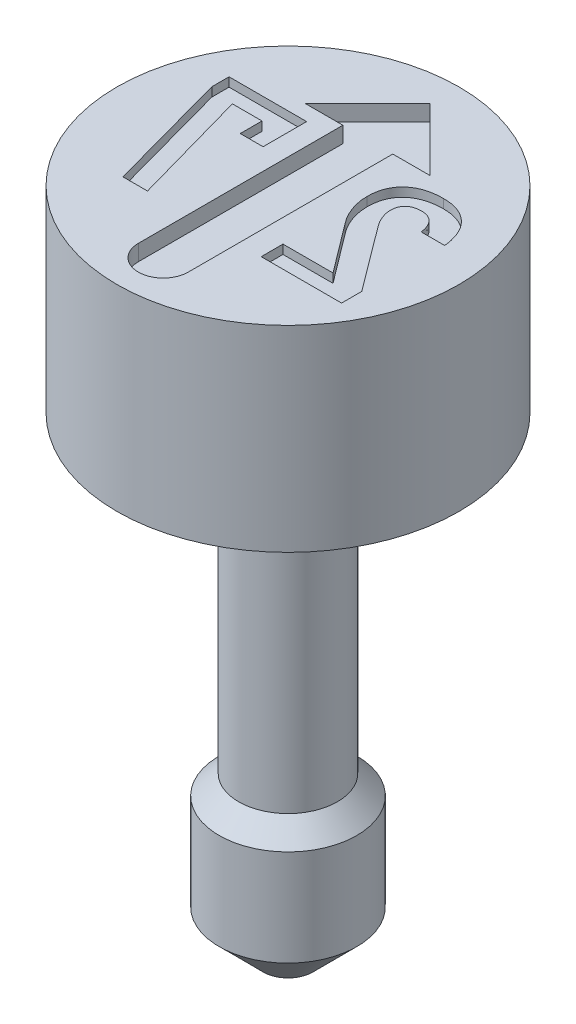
from build123d import *

# Parameters (mm, degrees)
CUT_EXTRUDE1_DEPTH = 0.4064
CUT_EXTRUDE2_DEPTH = 0.2286


with BuildPart() as part:
    # Sketch1 → Revolve1 (revolve)
    with BuildSketch(Plane.XY, mode=Mode.PRIVATE) as revolve1_sk:
        Polygon((0, 17.018), (4.3561, 17.018), (4.3561, 12.0142), (1.2573, 12.0142), (1.2573, 4.064), (1.7526, 3.5687), (1.7526, 1.1176), (0.635, 0), (0, 0), align=None)
    revolve(revolve1_sk.sketch.rotate(Axis((0, 0, 0), (0, 1, 0)), 90), axis=Axis((0, 0, 0), (0, 1, 0)))

    # Sketch2 → Cut-Extrude1 (cut)
    with BuildSketch(Plane(origin=(0, 17.018, 0), x_dir=(1, 0, 0), z_dir=(0, 1, 0))):
        with BuildLine():
            Line((0.635, -3.175), (0.635, 2.032))
            Line((0.635, 2.032), (1.5875, 2.032))
            Line((1.5875, 2.032), (0, 3.6195))
            Line((0, 3.6195), (-1.5875, 2.032))
            Line((-1.5875, 2.032), (-0.635, 2.032))
            Line((-0.635, 2.032), (-0.635, -3.175))
            ThreePointArc((-0.635, -3.175), (0, -3.81), (0.635, -3.175))
        make_face()
    extrude(amount=-CUT_EXTRUDE1_DEPTH, mode=Mode.SUBTRACT)

    # Sketch3 → Cut-Extrude2 (cut)
    with BuildSketch(Plane(origin=(0, 17.018, 0), x_dir=(1, 0, 0), z_dir=(0, 1, 0))):
        with BuildLine():
            Line((3.268806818, -1.905), (3.268806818, -1.391948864))
            Line((3.268806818, -1.391948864), (2.043545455, 0.250392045))
            add(Edge.make_bspline(
                [(2.043545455, 0.250392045), (2.028383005, 0.271385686), (1.998484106, 0.312783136), (1.958474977, 0.377147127), (1.924771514, 0.443012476), (1.895707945, 0.509162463), (1.872944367, 0.574829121), (1.855745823, 0.638623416), (1.846258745, 0.700381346), (1.844516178, 0.740805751), (1.843664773, 0.760556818)],
                knots=[0, 0, 0, 0, 1.116221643, 2.201082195, 3.263105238, 4.303340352, 5.313368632, 6.256511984, 7.148144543, 8, 8, 8, 8], degree=3))
            Line((1.843664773, 0.760556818), (1.843664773, 0.765607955))
            add(Edge.make_bspline(
                [(1.843664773, 0.765607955), (1.844637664, 0.794145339), (1.846498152, 0.848718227), (1.868077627, 0.925107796), (1.902378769, 0.991575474), (1.951289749, 1.046573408), (2.012143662, 1.090340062), (2.084848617, 1.121917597), (2.169013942, 1.139318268), (2.228674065, 1.1417318), (2.260022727, 1.143)],
                knots=[0, 0, 0, 0, 1.070617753, 2.047374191, 2.957911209, 3.861726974, 4.788257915, 5.756429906, 6.821106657, 8, 8, 8, 8], degree=3))
            add(Edge.make_bspline(
                [(2.260022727, 1.143), (2.290031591, 1.141881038), (2.348138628, 1.139714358), (2.430617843, 1.115233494), (2.505393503, 1.077620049), (2.569825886, 1.023269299), (2.623979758, 0.955521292), (2.666908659, 0.874905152), (2.696963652, 0.781190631), (2.707615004, 0.714087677), (2.713181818, 0.679017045)],
                knots=[0, 0, 0, 0, 0.999891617, 1.936119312, 2.849186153, 3.779495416, 4.728470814, 5.731748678, 6.81452301, 8, 8, 8, 8], degree=3))
            Line((2.713181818, 0.679017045), (2.713181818, 0.676852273))
            Line((2.713181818, 0.676852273), (3.312102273, 0.676852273))
            Line((3.312102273, 0.676852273), (3.312102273, 0.679017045))
            add(Edge.make_bspline(
                [(3.312102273, 0.679017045), (3.307486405, 0.718572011), (3.298477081, 0.795776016), (3.273972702, 0.907029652), (3.243990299, 1.011653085), (3.206428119, 1.109508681), (3.161602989, 1.200455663), (3.110516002, 1.285166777), (3.050617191, 1.361606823), (2.985257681, 1.432059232), (2.912761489, 1.49398034), (2.835234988, 1.548418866), (2.752694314, 1.594895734), (2.664871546, 1.632591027), (2.571902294, 1.661285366), (2.474156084, 1.682338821), (2.371219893, 1.694618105), (2.300945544, 1.69631542), (2.265073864, 1.697181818)],
                knots=[0, 0, 0, 0, 1.176458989, 2.296231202, 3.362707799, 4.39127888, 5.389699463, 6.356664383, 7.309489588, 8.255125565, 9.192870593, 10.121896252, 11.051411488, 11.987780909, 12.941242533, 13.922967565, 14.939774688, 16, 16, 16, 16], degree=3))
            add(Edge.make_bspline(
                [(2.265073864, 1.697181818), (2.22535394, 1.696603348), (2.148140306, 1.695478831), (2.03601717, 1.683513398), (1.930702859, 1.665137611), (1.832286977, 1.638599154), (1.740964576, 1.603891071), (1.656650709, 1.561745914), (1.578795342, 1.512778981), (1.508552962, 1.455329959), (1.445823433, 1.391238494), (1.39094248, 1.320740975), (1.345642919, 1.24322788), (1.306684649, 1.160261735), (1.278484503, 1.070040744), (1.257258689, 0.974255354), (1.245111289, 0.871992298), (1.243438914, 0.801718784), (1.242579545, 0.765607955)],
                knots=[0, 0, 0, 0, 1.211483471, 2.355066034, 3.436186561, 4.470562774, 5.460097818, 6.411901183, 7.342329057, 8.260432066, 9.17382984, 10.073682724, 10.9786387, 11.907937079, 12.864144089, 13.855989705, 14.898276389, 16, 16, 16, 16], degree=3))
            Line((1.242579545, 0.765607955), (1.242579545, 0.763443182))
            add(Edge.make_bspline(
                [(1.242579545, 0.763443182), (1.243526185, 0.727064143), (1.245427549, 0.653995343), (1.261870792, 0.544056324), (1.285615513, 0.432975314), (1.321707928, 0.322354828), (1.36517637, 0.212823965), (1.418175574, 0.106878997), (1.478658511, 0.004206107), (1.525612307, -0.060021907), (1.549255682, -0.092363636)],
                knots=[0, 0, 0, 0, 0.943703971, 1.895468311, 2.880041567, 3.888955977, 4.911454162, 5.936103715, 6.960734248, 8, 8, 8, 8], degree=3))
            Line((1.549255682, -0.092363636), (2.496704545, -1.350818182))
            Line((2.496704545, -1.350818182), (1.223096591, -1.350818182))
            Line((1.223096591, -1.350818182), (1.223096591, -1.905))
            Line((1.223096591, -1.905), (3.268806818, -1.905))
        make_face()
        Polygon((-3.151764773, 1.651), (-3.151764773, 1.210829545), (-2.296679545, -1.905), (-1.671060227, -1.905), (-2.513156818, 1.096818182), (-1.758372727, 1.096818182), (-1.758372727, 0.542636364), (-1.176770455, 0.542636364), (-1.176770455, 1.651), align=None)
    extrude(amount=-CUT_EXTRUDE2_DEPTH, mode=Mode.SUBTRACT)


solid = part.part
